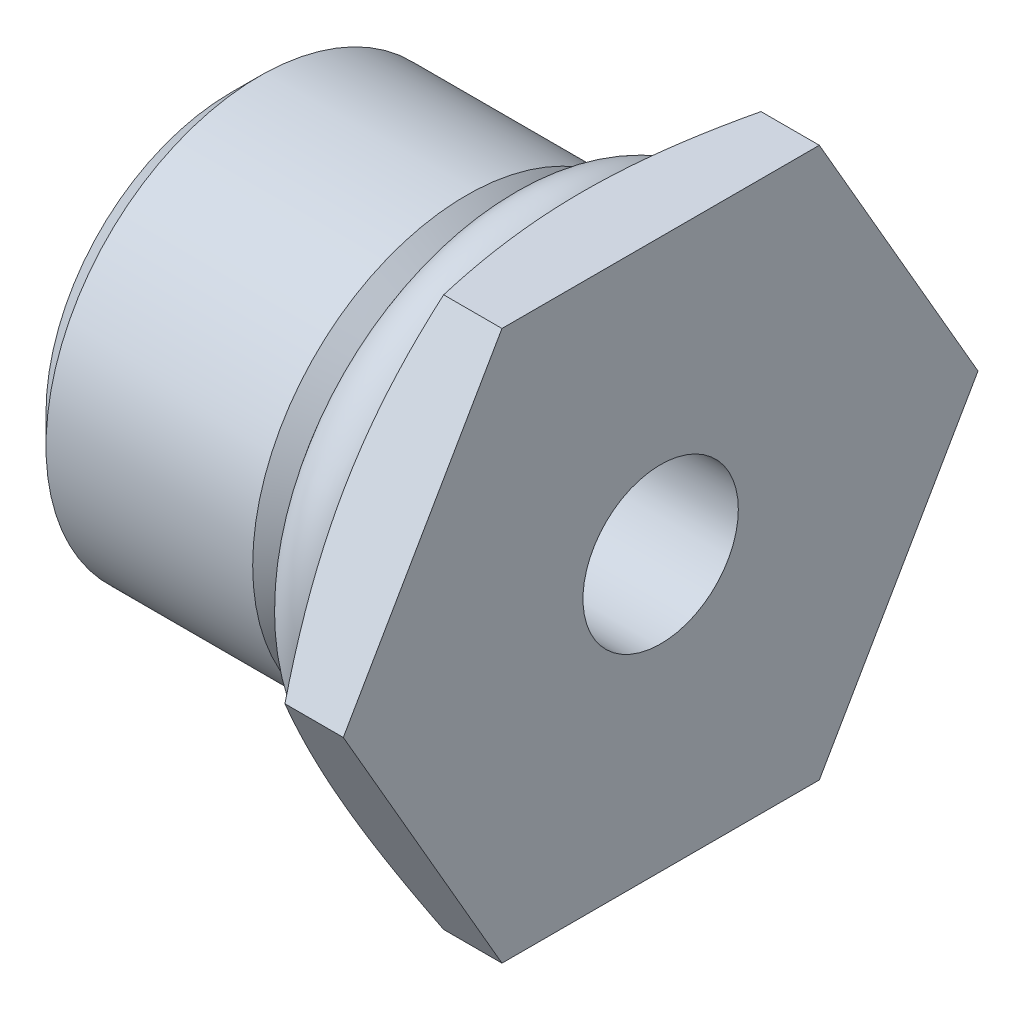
ISO-10303-21;
HEADER;
FILE_DESCRIPTION(('STEP AP214'),'2;1');
FILE_NAME('part.step','',(''),(''),'','','');
FILE_SCHEMA(('AUTOMOTIVE_DESIGN { 1 0 10303 214 1 1 1 1 }'));
ENDSEC;
DATA;
#1=APPLICATION_CONTEXT('core data for automotive mechanical design processes');
#2=APPLICATION_PROTOCOL_DEFINITION('international standard','automotive_design',2000,#1);
#3=PRODUCT_CONTEXT('',#1,'mechanical');
#4=PRODUCT('Part','Part','',(#3));
#5=PRODUCT_RELATED_PRODUCT_CATEGORY('part','',(#4));
#6=PRODUCT_DEFINITION_FORMATION('','',#4);
#7=PRODUCT_DEFINITION_CONTEXT('part definition',#1,'design');
#8=PRODUCT_DEFINITION('design','',#6,#7);
#9=PRODUCT_DEFINITION_SHAPE('','',#8);
#10=(LENGTH_UNIT() NAMED_UNIT(*) SI_UNIT(.MILLI.,.METRE.));
#11=(NAMED_UNIT(*) PLANE_ANGLE_UNIT() SI_UNIT($,.RADIAN.));
#12=(NAMED_UNIT(*) SI_UNIT($,.STERADIAN.) SOLID_ANGLE_UNIT());
#13=UNCERTAINTY_MEASURE_WITH_UNIT(LENGTH_MEASURE(1.E-05),#10,'distance_accuracy_value','');
#14=(GEOMETRIC_REPRESENTATION_CONTEXT(3) GLOBAL_UNCERTAINTY_ASSIGNED_CONTEXT((#13)) GLOBAL_UNIT_ASSIGNED_CONTEXT((#10,
#11,#12)) REPRESENTATION_CONTEXT('',''));
#15=CARTESIAN_POINT('',(0.,0.,0.));
#16=DIRECTION('',(0.,0.,1.));
#17=DIRECTION('',(1.,0.,0.));
#18=AXIS2_PLACEMENT_3D('',#15,#16,#17);
#19=CARTESIAN_POINT('',(11.176,7.14375,-8.2488919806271));
#20=DIRECTION('',(-1.,0.,0.));
#21=DIRECTION('',(0.,-1.,0.));
#22=AXIS2_PLACEMENT_3D('',#19,#20,#21);
#23=PLANE('',#22);
#24=DIRECTION('',(0.,-0.866025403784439,0.5));
#25=VECTOR('',#24,1.);
#26=CARTESIAN_POINT('',(11.176,0.,8.24889197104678));
#27=LINE('',#26,#25);
#28=CARTESIAN_POINT('',(11.176,7.14375,4.12444598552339));
#29=VERTEX_POINT('',#28);
#30=CARTESIAN_POINT('',(11.176,0.,8.24889197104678));
#31=VERTEX_POINT('',#30);
#32=EDGE_CURVE('P0_E98',#29,#31,#27,.T.);
#33=ORIENTED_EDGE('',*,*,#32,.T.);
#34=DIRECTION('',(0.,-0.866025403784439,-0.5));
#35=VECTOR('',#34,1.);
#36=CARTESIAN_POINT('',(11.176,-7.14375,4.12444598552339));
#37=LINE('',#36,#35);
#38=CARTESIAN_POINT('',(11.176,-7.14374999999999,4.12444598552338));
#39=VERTEX_POINT('',#38);
#40=EDGE_CURVE('P0_E120',#31,#39,#37,.T.);
#41=ORIENTED_EDGE('',*,*,#40,.T.);
#42=DIRECTION('',(0.,0.,1.));
#43=VECTOR('',#42,1.);
#44=CARTESIAN_POINT('',(11.176,-7.14374999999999,-8.2488919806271));
#45=LINE('',#44,#43);
#46=CARTESIAN_POINT('',(11.176,-7.14374999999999,-4.12444598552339));
#47=VERTEX_POINT('',#46);
#48=EDGE_CURVE('P0_E360',#47,#39,#45,.T.);
#49=ORIENTED_EDGE('',*,*,#48,.F.);
#50=DIRECTION('',(0.,0.866025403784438,-0.500000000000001));
#51=VECTOR('',#50,1.);
#52=CARTESIAN_POINT('',(11.176,0.,-8.24889197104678));
#53=LINE('',#52,#51);
#54=CARTESIAN_POINT('',(11.176,0.,-8.24889197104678));
#55=VERTEX_POINT('',#54);
#56=EDGE_CURVE('P0_E53',#47,#55,#53,.T.);
#57=ORIENTED_EDGE('',*,*,#56,.T.);
#58=DIRECTION('',(0.,0.866025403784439,0.5));
#59=VECTOR('',#58,1.);
#60=CARTESIAN_POINT('',(11.176,7.14375,-4.1244459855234));
#61=LINE('',#60,#59);
#62=CARTESIAN_POINT('',(11.176,7.14375,-4.12444598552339));
#63=VERTEX_POINT('',#62);
#64=EDGE_CURVE('P0_E11',#55,#63,#61,.T.);
#65=ORIENTED_EDGE('',*,*,#64,.T.);
#66=DIRECTION('',(0.,0.,1.));
#67=VECTOR('',#66,1.);
#68=CARTESIAN_POINT('',(11.176,7.14375,-8.2488919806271));
#69=LINE('',#68,#67);
#70=EDGE_CURVE('P0_E317',#63,#29,#69,.T.);
#71=ORIENTED_EDGE('',*,*,#70,.T.);
#72=EDGE_LOOP('',(#33,#41,#49,#57,#65,#71));
#73=FACE_BOUND('',#72,.T.);
#74=CARTESIAN_POINT('',(11.176,0.,0.));
#75=DIRECTION('',(1.,0.,0.));
#76=DIRECTION('',(0.,0.,-1.));
#77=AXIS2_PLACEMENT_3D('',#74,#75,#76);
#78=CIRCLE('',#77,2.01929999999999);
#79=CARTESIAN_POINT('',(11.176,0.,-2.01929999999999));
#80=VERTEX_POINT('',#79);
#81=EDGE_CURVE('P0_E364',#80,#80,#78,.T.);
#82=ORIENTED_EDGE('',*,*,#81,.F.);
#83=EDGE_LOOP('',(#82));
#84=FACE_BOUND('',#83,.T.);
#85=ADVANCED_FACE('P0_F38',(#73,#84),#23,.F.);
#86=CARTESIAN_POINT('',(0.,0.,0.));
#87=DIRECTION('',(-1.,0.,0.));
#88=DIRECTION('',(0.,0.,1.));
#89=AXIS2_PLACEMENT_3D('',#86,#87,#88);
#90=CONICAL_SURFACE('',#89,2.88036000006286,1.02974425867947);
#91=CARTESIAN_POINT('',(0.517377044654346,0.,0.));
#92=DIRECTION('',(-1.,0.,0.));
#93=DIRECTION('',(0.,0.,1.));
#94=AXIS2_PLACEMENT_3D('',#91,#92,#93);
#95=CIRCLE('',#94,2.01929999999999);
#96=CARTESIAN_POINT('',(0.517377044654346,0.,2.01929999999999));
#97=VERTEX_POINT('',#96);
#98=EDGE_CURVE('P0_E42',#97,#97,#95,.F.);
#99=ORIENTED_EDGE('',*,*,#98,.T.);
#100=EDGE_LOOP('',(#99));
#101=FACE_BOUND('',#100,.T.);
#102=CARTESIAN_POINT('',(1.36620416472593E-10,0.,0.));
#103=DIRECTION('',(-1.,0.,0.));
#104=DIRECTION('',(0.,0.,1.));
#105=AXIS2_PLACEMENT_3D('',#102,#103,#104);
#106=CIRCLE('',#105,2.88035999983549);
#107=CARTESIAN_POINT('',(1.3661988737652E-10,0.,2.88035999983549));
#108=VERTEX_POINT('',#107);
#109=EDGE_CURVE('P0_E278',#108,#108,#106,.F.);
#110=ORIENTED_EDGE('',*,*,#109,.F.);
#111=EDGE_LOOP('',(#110));
#112=FACE_BOUND('',#111,.T.);
#113=ADVANCED_FACE('P0_F40',(#101,#112),#90,.F.);
#114=CARTESIAN_POINT('',(0.,0.,2.4003));
#115=DIRECTION('',(-1.,0.,0.));
#116=DIRECTION('',(0.,0.,1.));
#117=AXIS2_PLACEMENT_3D('',#114,#115,#116);
#118=PLANE('',#117);
#119=CARTESIAN_POINT('',(0.,0.,0.));
#120=DIRECTION('',(1.,0.,0.));
#121=DIRECTION('',(0.,0.,-1.));
#122=AXIS2_PLACEMENT_3D('',#119,#120,#121);
#123=CIRCLE('',#122,4.80060000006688);
#124=CARTESIAN_POINT('',(0.,0.,-4.80060000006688));
#125=VERTEX_POINT('',#124);
#126=EDGE_CURVE('P0_E275',#125,#125,#123,.T.);
#127=ORIENTED_EDGE('',*,*,#126,.F.);
#128=EDGE_LOOP('',(#127));
#129=FACE_BOUND('',#128,.T.);
#130=ORIENTED_EDGE('',*,*,#109,.T.);
#131=EDGE_LOOP('',(#130));
#132=FACE_BOUND('',#131,.T.);
#133=ADVANCED_FACE('P0_F203',(#129,#132),#118,.T.);
#134=CARTESIAN_POINT('',(0.755649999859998,0.,0.));
#135=DIRECTION('',(1.,0.,0.));
#136=DIRECTION('',(0.,0.,-1.));
#137=AXIS2_PLACEMENT_3D('',#134,#135,#136);
#138=CONICAL_SURFACE('',#137,5.55624999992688,0.785398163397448);
#139=ORIENTED_EDGE('',*,*,#126,.T.);
#140=EDGE_LOOP('',(#139));
#141=FACE_BOUND('',#140,.T.);
#142=CARTESIAN_POINT('',(0.75565,0.,0.));
#143=DIRECTION('',(1.,0.,0.));
#144=DIRECTION('',(0.,0.,-1.));
#145=AXIS2_PLACEMENT_3D('',#142,#143,#144);
#146=CIRCLE('',#145,5.55625);
#147=CARTESIAN_POINT('',(0.755650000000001,0.,-5.55625));
#148=VERTEX_POINT('',#147);
#149=EDGE_CURVE('P0_E248',#148,#148,#146,.T.);
#150=ORIENTED_EDGE('',*,*,#149,.F.);
#151=EDGE_LOOP('',(#150));
#152=FACE_BOUND('',#151,.T.);
#153=ADVANCED_FACE('P0_F200',(#141,#152),#138,.T.);
#154=CARTESIAN_POINT('',(3.4417,0.,0.));
#155=DIRECTION('',(1.,0.,0.));
#156=DIRECTION('',(0.,0.,-1.));
#157=AXIS2_PLACEMENT_3D('',#154,#155,#156);
#158=CYLINDRICAL_SURFACE('',#157,5.55625);
#159=ORIENTED_EDGE('',*,*,#149,.T.);
#160=EDGE_LOOP('',(#159));
#161=FACE_BOUND('',#160,.T.);
#162=CARTESIAN_POINT('',(6.12775000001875,0.,0.));
#163=DIRECTION('',(-1.,0.,0.));
#164=DIRECTION('',(0.,0.,1.));
#165=AXIS2_PLACEMENT_3D('',#162,#163,#164);
#166=CIRCLE('',#165,5.55624999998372);
#167=CARTESIAN_POINT('',(6.12775000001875,0.,5.55624999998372));
#168=VERTEX_POINT('',#167);
#169=EDGE_CURVE('P0_E298',#168,#168,#166,.F.);
#170=ORIENTED_EDGE('',*,*,#169,.F.);
#171=EDGE_LOOP('',(#170));
#172=FACE_BOUND('',#171,.T.);
#173=ADVANCED_FACE('P0_F196',(#161,#172),#158,.T.);
#174=CARTESIAN_POINT('',(6.12774999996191,0.,0.));
#175=DIRECTION('',(-1.,0.,0.));
#176=DIRECTION('',(0.,0.,1.));
#177=AXIS2_PLACEMENT_3D('',#174,#175,#176);
#178=CONICAL_SURFACE('',#177,5.55625000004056,0.785398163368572);
#179=ORIENTED_EDGE('',*,*,#169,.T.);
#180=EDGE_LOOP('',(#179));
#181=FACE_BOUND('',#180,.T.);
#182=CARTESIAN_POINT('',(7.112,0.,0.));
#183=DIRECTION('',(1.,0.,0.));
#184=DIRECTION('',(0.,0.,-1.));
#185=AXIS2_PLACEMENT_3D('',#182,#183,#184);
#186=CIRCLE('',#185,4.572);
#187=CARTESIAN_POINT('',(7.112,0.,-4.572));
#188=VERTEX_POINT('',#187);
#189=EDGE_CURVE('P0_E274',#188,#188,#186,.T.);
#190=ORIENTED_EDGE('',*,*,#189,.F.);
#191=EDGE_LOOP('',(#190));
#192=FACE_BOUND('',#191,.T.);
#193=ADVANCED_FACE('P0_F192',(#181,#192),#178,.T.);
#194=CARTESIAN_POINT('',(8.128,0.,0.));
#195=DIRECTION('',(1.,0.,0.));
#196=DIRECTION('',(0.,0.,-1.));
#197=AXIS2_PLACEMENT_3D('',#194,#195,#196);
#198=CYLINDRICAL_SURFACE('',#197,4.572);
#199=ORIENTED_EDGE('',*,*,#189,.T.);
#200=EDGE_LOOP('',(#199));
#201=FACE_BOUND('',#200,.T.);
#202=CARTESIAN_POINT('',(9.144,0.,0.));
#203=DIRECTION('',(1.,0.,0.));
#204=DIRECTION('',(0.,0.,-1.));
#205=AXIS2_PLACEMENT_3D('',#202,#203,#204);
#206=CIRCLE('',#205,4.572);
#207=CARTESIAN_POINT('',(9.144,0.,-4.572));
#208=VERTEX_POINT('',#207);
#209=EDGE_CURVE('P0_E271',#208,#208,#206,.F.);
#210=ORIENTED_EDGE('',*,*,#209,.T.);
#211=EDGE_LOOP('',(#210));
#212=FACE_BOUND('',#211,.T.);
#213=ADVANCED_FACE('P0_F189',(#201,#212),#198,.T.);
#214=CARTESIAN_POINT('',(9.144,0.,0.));
#215=DIRECTION('',(1.,0.,0.));
#216=DIRECTION('',(0.,1.,0.));
#217=AXIS2_PLACEMENT_3D('',#214,#215,#216);
#218=PLANE('',#217);
#219=CARTESIAN_POINT('',(9.144,0.,0.));
#220=DIRECTION('',(1.,0.,0.));
#221=DIRECTION('',(0.,0.,-1.));
#222=AXIS2_PLACEMENT_3D('',#219,#220,#221);
#223=CIRCLE('',#222,7.14375);
#224=CARTESIAN_POINT('',(9.144,3.571875,6.18666897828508));
#225=VERTEX_POINT('',#224);
#226=CARTESIAN_POINT('',(9.144,7.14375,0.));
#227=VERTEX_POINT('',#226);
#228=EDGE_CURVE('P0_E90',#225,#227,#223,.F.);
#229=ORIENTED_EDGE('',*,*,#228,.T.);
#230=CARTESIAN_POINT('',(9.144,0.,0.));
#231=DIRECTION('',(1.,0.,0.));
#232=DIRECTION('',(0.,0.,-1.));
#233=AXIS2_PLACEMENT_3D('',#230,#231,#232);
#234=CIRCLE('',#233,7.14375);
#235=CARTESIAN_POINT('',(9.144,3.571875,-6.18666897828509));
#236=VERTEX_POINT('',#235);
#237=EDGE_CURVE('P0_E261',#227,#236,#234,.F.);
#238=ORIENTED_EDGE('',*,*,#237,.T.);
#239=CARTESIAN_POINT('',(9.144,0.,0.));
#240=DIRECTION('',(1.,0.,0.));
#241=DIRECTION('',(0.,0.,-1.));
#242=AXIS2_PLACEMENT_3D('',#239,#240,#241);
#243=CIRCLE('',#242,7.14375);
#244=CARTESIAN_POINT('',(9.144,-3.57187500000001,-6.18666897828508));
#245=VERTEX_POINT('',#244);
#246=EDGE_CURVE('P0_E263',#236,#245,#243,.F.);
#247=ORIENTED_EDGE('',*,*,#246,.T.);
#248=CARTESIAN_POINT('',(9.144,0.,0.));
#249=DIRECTION('',(1.,0.,0.));
#250=DIRECTION('',(0.,0.,-1.));
#251=AXIS2_PLACEMENT_3D('',#248,#249,#250);
#252=CIRCLE('',#251,7.14375);
#253=CARTESIAN_POINT('',(9.144,-7.14375,0.));
#254=VERTEX_POINT('',#253);
#255=EDGE_CURVE('P0_E265',#245,#254,#252,.F.);
#256=ORIENTED_EDGE('',*,*,#255,.T.);
#257=CARTESIAN_POINT('',(9.144,0.,0.));
#258=DIRECTION('',(1.,0.,0.));
#259=DIRECTION('',(0.,0.,-1.));
#260=AXIS2_PLACEMENT_3D('',#257,#258,#259);
#261=CIRCLE('',#260,7.14375);
#262=CARTESIAN_POINT('',(9.144,-3.571875,6.18666897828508));
#263=VERTEX_POINT('',#262);
#264=EDGE_CURVE('P0_E267',#254,#263,#261,.F.);
#265=ORIENTED_EDGE('',*,*,#264,.T.);
#266=CARTESIAN_POINT('',(9.144,0.,0.));
#267=DIRECTION('',(1.,0.,0.));
#268=DIRECTION('',(0.,0.,-1.));
#269=AXIS2_PLACEMENT_3D('',#266,#267,#268);
#270=CIRCLE('',#269,7.14375);
#271=EDGE_CURVE('P0_E133',#263,#225,#270,.F.);
#272=ORIENTED_EDGE('',*,*,#271,.T.);
#273=EDGE_LOOP('',(#229,#238,#247,#256,#265,#272));
#274=FACE_BOUND('',#273,.T.);
#275=ORIENTED_EDGE('',*,*,#209,.F.);
#276=EDGE_LOOP('',(#275));
#277=FACE_BOUND('',#276,.T.);
#278=ADVANCED_FACE('P0_F184',(#274,#277),#218,.F.);
#279=CARTESIAN_POINT('',(9.144,0.,0.));
#280=DIRECTION('',(1.,0.,0.));
#281=DIRECTION('',(0.,0.,-1.));
#282=AXIS2_PLACEMENT_3D('',#279,#280,#281);
#283=CONICAL_SURFACE('',#282,7.14375,1.13446401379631);
#284=ORIENTED_EDGE('',*,*,#228,.F.);
#285=CARTESIAN_POINT('',(9.65933616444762,7.14375,4.12444598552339));
#286=CARTESIAN_POINT('',(9.58040947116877,6.85069189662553,4.29364316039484));
#287=CARTESIAN_POINT('',(9.50838008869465,6.55605482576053,4.46375195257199));
#288=CARTESIAN_POINT('',(9.38158796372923,5.96505481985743,4.80496596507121));
#289=CARTESIAN_POINT('',(9.32676799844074,5.66870101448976,4.97606591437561));
#290=CARTESIAN_POINT('',(9.25964246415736,5.22234154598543,5.23377167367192));
#291=CARTESIAN_POINT('',(9.2397794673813,5.0731865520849,5.31988634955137));
#292=CARTESIAN_POINT('',(9.20543600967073,4.77441098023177,5.49238450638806));
#293=CARTESIAN_POINT('',(9.19095547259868,4.62479040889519,5.57876798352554));
#294=CARTESIAN_POINT('',(9.16761931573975,4.32471681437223,5.75201555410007));
#295=CARTESIAN_POINT('',(9.15878262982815,4.17426267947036,5.83888028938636));
#296=CARTESIAN_POINT('',(9.14696231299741,3.87316545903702,6.01271885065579));
#297=CARTESIAN_POINT('',(9.14397935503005,3.72252235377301,6.09969268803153));
#298=CARTESIAN_POINT('',(9.144,3.571875,6.18666897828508));
#299=B_SPLINE_CURVE_WITH_KNOTS('',3,(#285,#286,#287,#288,#289,#290,#291,#292,#293,#294,#295,
#296,#297,#298),.UNSPECIFIED.,.F.,.F.,(4,2,2,2,2,2,4),(0.,1.04269338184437,2.08188206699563,
2.60191814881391,3.12194687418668,3.64371114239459,4.1655353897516),.UNSPECIFIED.);
#300=CARTESIAN_POINT('',(9.65933616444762,7.14375,4.12444598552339));
#301=VERTEX_POINT('',#300);
#302=EDGE_CURVE('P0_E128',#301,#225,#299,.T.);
#303=ORIENTED_EDGE('',*,*,#302,.F.);
#304=CARTESIAN_POINT('',(9.144,7.14375,0.));
#305=CARTESIAN_POINT('',(9.14397935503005,7.14375,0.1739525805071));
#306=CARTESIAN_POINT('',(9.14696231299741,7.14375,0.347900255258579));
#307=CARTESIAN_POINT('',(9.15878262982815,7.14375,0.695577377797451));
#308=CARTESIAN_POINT('',(9.16761931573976,7.14375,0.869306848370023));
#309=CARTESIAN_POINT('',(9.19095547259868,7.14375,1.21580198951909));
#310=CARTESIAN_POINT('',(9.20543600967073,7.14375,1.38856894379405));
#311=CARTESIAN_POINT('',(9.2397794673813,7.14375,1.73356525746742));
#312=CARTESIAN_POINT('',(9.25964246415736,7.14375,1.90579460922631));
#313=CARTESIAN_POINT('',(9.32676799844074,7.14375,2.42120612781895));
#314=CARTESIAN_POINT('',(9.38158796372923,7.14375,2.76340602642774));
#315=CARTESIAN_POINT('',(9.50838008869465,7.14375,3.44583405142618));
#316=CARTESIAN_POINT('',(9.58040947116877,7.14375,3.78605163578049));
#317=CARTESIAN_POINT('',(9.65933616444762,7.14375,4.12444598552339));
#318=B_SPLINE_CURVE_WITH_KNOTS('',3,(#304,#305,#306,#307,#308,#309,#310,#311,#312,#313,#314,
#315,#316,#317),.UNSPECIFIED.,.F.,.F.,(4,2,2,2,2,2,4),(0.,0.521824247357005,1.04358851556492,
1.56361724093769,2.08365332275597,3.12284200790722,4.16553538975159),.UNSPECIFIED.);
#319=EDGE_CURVE('P0_E175',#227,#301,#318,.T.);
#320=ORIENTED_EDGE('',*,*,#319,.F.);
#321=EDGE_LOOP('',(#284,#303,#320));
#322=FACE_BOUND('',#321,.T.);
#323=ADVANCED_FACE('P0_F180',(#322),#283,.T.);
#324=CARTESIAN_POINT('',(9.144,0.,0.));
#325=DIRECTION('',(1.,0.,0.));
#326=DIRECTION('',(0.,0.,-1.));
#327=AXIS2_PLACEMENT_3D('',#324,#325,#326);
#328=CONICAL_SURFACE('',#327,7.14375,1.13446401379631);
#329=ORIENTED_EDGE('',*,*,#271,.F.);
#330=CARTESIAN_POINT('',(9.65933616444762,0.,8.24889197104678));
#331=CARTESIAN_POINT('',(9.58040947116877,-0.293058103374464,8.07969479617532));
#332=CARTESIAN_POINT('',(9.50838008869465,-0.587695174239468,7.90958600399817));
#333=CARTESIAN_POINT('',(9.38158796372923,-1.17869518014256,7.56837199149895));
#334=CARTESIAN_POINT('',(9.32676799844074,-1.47504898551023,7.39727204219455));
#335=CARTESIAN_POINT('',(9.25964246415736,-1.92140845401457,7.13956628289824));
#336=CARTESIAN_POINT('',(9.2397794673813,-2.0705634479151,7.05345160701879));
#337=CARTESIAN_POINT('',(9.20543600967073,-2.36933901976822,6.88095345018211));
#338=CARTESIAN_POINT('',(9.19095547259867,-2.51895959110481,6.79456997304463));
#339=CARTESIAN_POINT('',(9.16761931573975,-2.81903318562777,6.62132240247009));
#340=CARTESIAN_POINT('',(9.15878262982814,-2.96948732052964,6.53445766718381));
#341=CARTESIAN_POINT('',(9.14696231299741,-3.27058454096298,6.36061910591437));
#342=CARTESIAN_POINT('',(9.14397935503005,-3.42122764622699,6.27364526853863));
#343=CARTESIAN_POINT('',(9.144,-3.571875,6.18666897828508));
#344=B_SPLINE_CURVE_WITH_KNOTS('',3,(#330,#331,#332,#333,#334,#335,#336,#337,#338,#339,#340,
#341,#342,#343),.UNSPECIFIED.,.F.,.F.,(4,2,2,2,2,2,4),(0.,1.04269338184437,2.08188206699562,
2.60191814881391,3.12194687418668,3.64371114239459,4.16553538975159),.UNSPECIFIED.);
#345=CARTESIAN_POINT('',(9.65933616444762,0.,8.24889197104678));
#346=VERTEX_POINT('',#345);
#347=EDGE_CURVE('P0_E118',#346,#263,#344,.T.);
#348=ORIENTED_EDGE('',*,*,#347,.F.);
#349=CARTESIAN_POINT('',(9.144,3.571875,6.18666897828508));
#350=CARTESIAN_POINT('',(9.14397935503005,3.42122764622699,6.27364526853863));
#351=CARTESIAN_POINT('',(9.14696231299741,3.27058454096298,6.36061910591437));
#352=CARTESIAN_POINT('',(9.15878262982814,2.96948732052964,6.53445766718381));
#353=CARTESIAN_POINT('',(9.16761931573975,2.81903318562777,6.62132240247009));
#354=CARTESIAN_POINT('',(9.19095547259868,2.51895959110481,6.79456997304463));
#355=CARTESIAN_POINT('',(9.20543600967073,2.36933901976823,6.88095345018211));
#356=CARTESIAN_POINT('',(9.2397794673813,2.0705634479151,7.05345160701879));
#357=CARTESIAN_POINT('',(9.25964246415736,1.92140845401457,7.13956628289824));
#358=CARTESIAN_POINT('',(9.32676799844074,1.47504898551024,7.39727204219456));
#359=CARTESIAN_POINT('',(9.38158796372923,1.17869518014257,7.56837199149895));
#360=CARTESIAN_POINT('',(9.50838008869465,0.587695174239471,7.90958600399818));
#361=CARTESIAN_POINT('',(9.58040947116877,0.293058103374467,8.07969479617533));
#362=CARTESIAN_POINT('',(9.65933616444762,0.,8.24889197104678));
#363=B_SPLINE_CURVE_WITH_KNOTS('',3,(#349,#350,#351,#352,#353,#354,#355,#356,#357,#358,#359,
#360,#361,#362),.UNSPECIFIED.,.F.,.F.,(4,2,2,2,2,2,4),(0.,0.521824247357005,1.04358851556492,
1.56361724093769,2.08365332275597,3.12284200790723,4.16553538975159),.UNSPECIFIED.);
#364=EDGE_CURVE('P0_E122',#225,#346,#363,.T.);
#365=ORIENTED_EDGE('',*,*,#364,.F.);
#366=EDGE_LOOP('',(#329,#348,#365));
#367=FACE_BOUND('',#366,.T.);
#368=ADVANCED_FACE('P0_F132',(#367),#328,.T.);
#369=CARTESIAN_POINT('',(9.144,0.,0.));
#370=DIRECTION('',(1.,0.,0.));
#371=DIRECTION('',(0.,0.,-1.));
#372=AXIS2_PLACEMENT_3D('',#369,#370,#371);
#373=CONICAL_SURFACE('',#372,7.14375,1.13446401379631);
#374=CARTESIAN_POINT('',(9.144,-3.571875,6.18666897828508));
#375=CARTESIAN_POINT('',(9.14397935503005,-3.722522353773,6.09969268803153));
#376=CARTESIAN_POINT('',(9.14696231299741,-3.87316545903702,6.01271885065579));
#377=CARTESIAN_POINT('',(9.15878262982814,-4.17426267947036,5.83888028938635));
#378=CARTESIAN_POINT('',(9.16761931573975,-4.32471681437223,5.75201555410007));
#379=CARTESIAN_POINT('',(9.19095547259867,-4.62479040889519,5.57876798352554));
#380=CARTESIAN_POINT('',(9.20543600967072,-4.77441098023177,5.49238450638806));
#381=CARTESIAN_POINT('',(9.2397794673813,-5.07318655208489,5.31988634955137));
#382=CARTESIAN_POINT('',(9.25964246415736,-5.22234154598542,5.23377167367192));
#383=CARTESIAN_POINT('',(9.32676799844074,-5.66870101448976,4.97606591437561));
#384=CARTESIAN_POINT('',(9.38158796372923,-5.96505481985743,4.80496596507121));
#385=CARTESIAN_POINT('',(9.50838008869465,-6.55605482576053,4.46375195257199));
#386=CARTESIAN_POINT('',(9.58040947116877,-6.85069189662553,4.29364316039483));
#387=CARTESIAN_POINT('',(9.65933616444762,-7.14375,4.12444598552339));
#388=B_SPLINE_CURVE_WITH_KNOTS('',3,(#374,#375,#376,#377,#378,#379,#380,#381,#382,#383,#384,
#385,#386,#387),.UNSPECIFIED.,.F.,.F.,(4,2,2,2,2,2,4),(0.,0.521824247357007,1.04358851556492,
1.56361724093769,2.08365332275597,3.12284200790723,4.1655353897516),.UNSPECIFIED.);
#389=CARTESIAN_POINT('',(9.65933616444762,-7.14375,4.12444598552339));
#390=VERTEX_POINT('',#389);
#391=EDGE_CURVE('P0_E135',#263,#390,#388,.T.);
#392=ORIENTED_EDGE('',*,*,#391,.F.);
#393=ORIENTED_EDGE('',*,*,#264,.F.);
#394=CARTESIAN_POINT('',(9.65933616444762,-7.14374999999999,4.12444598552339));
#395=CARTESIAN_POINT('',(9.58040947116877,-7.14374999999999,3.78605163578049));
#396=CARTESIAN_POINT('',(9.50838008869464,-7.14374999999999,3.44583405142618));
#397=CARTESIAN_POINT('',(9.38158796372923,-7.14374999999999,2.76340602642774));
#398=CARTESIAN_POINT('',(9.32676799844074,-7.14374999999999,2.42120612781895));
#399=CARTESIAN_POINT('',(9.25964246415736,-7.14374999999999,1.90579460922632));
#400=CARTESIAN_POINT('',(9.2397794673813,-7.14374999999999,1.73356525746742));
#401=CARTESIAN_POINT('',(9.20543600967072,-7.14374999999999,1.38856894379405));
#402=CARTESIAN_POINT('',(9.19095547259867,-7.14375,1.21580198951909));
#403=CARTESIAN_POINT('',(9.16761931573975,-7.14375,0.869306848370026));
#404=CARTESIAN_POINT('',(9.15878262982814,-7.14375,0.695577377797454));
#405=CARTESIAN_POINT('',(9.14696231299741,-7.14375,0.347900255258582));
#406=CARTESIAN_POINT('',(9.14397935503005,-7.14375,0.173952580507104));
#407=CARTESIAN_POINT('',(9.144,-7.14375,0.));
#408=B_SPLINE_CURVE_WITH_KNOTS('',3,(#394,#395,#396,#397,#398,#399,#400,#401,#402,#403,#404,
#405,#406,#407),.UNSPECIFIED.,.F.,.F.,(4,2,2,2,2,2,4),(0.,1.04269338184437,2.08188206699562,
2.60191814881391,3.12194687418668,3.64371114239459,4.16553538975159),.UNSPECIFIED.);
#409=EDGE_CURVE('P0_E294',#390,#254,#408,.T.);
#410=ORIENTED_EDGE('',*,*,#409,.F.);
#411=EDGE_LOOP('',(#392,#393,#410));
#412=FACE_BOUND('',#411,.T.);
#413=ADVANCED_FACE('P0_F346',(#412),#373,.T.);
#414=CARTESIAN_POINT('',(9.144,0.,0.));
#415=DIRECTION('',(1.,0.,0.));
#416=DIRECTION('',(0.,0.,-1.));
#417=AXIS2_PLACEMENT_3D('',#414,#415,#416);
#418=CONICAL_SURFACE('',#417,7.14375,1.13446401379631);
#419=CARTESIAN_POINT('',(9.144,-7.14375,0.));
#420=CARTESIAN_POINT('',(9.14397935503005,-7.14375,-0.1739525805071));
#421=CARTESIAN_POINT('',(9.14696231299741,-7.14375,-0.347900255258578));
#422=CARTESIAN_POINT('',(9.15878262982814,-7.14375,-0.69557737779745));
#423=CARTESIAN_POINT('',(9.16761931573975,-7.14375,-0.869306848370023));
#424=CARTESIAN_POINT('',(9.19095547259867,-7.14375,-1.21580198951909));
#425=CARTESIAN_POINT('',(9.20543600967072,-7.14375,-1.38856894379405));
#426=CARTESIAN_POINT('',(9.2397794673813,-7.14375,-1.73356525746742));
#427=CARTESIAN_POINT('',(9.25964246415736,-7.14375,-1.90579460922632));
#428=CARTESIAN_POINT('',(9.32676799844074,-7.14375,-2.42120612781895));
#429=CARTESIAN_POINT('',(9.38158796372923,-7.14375,-2.76340602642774));
#430=CARTESIAN_POINT('',(9.50838008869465,-7.14375,-3.44583405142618));
#431=CARTESIAN_POINT('',(9.58040947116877,-7.14375,-3.78605163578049));
#432=CARTESIAN_POINT('',(9.65933616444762,-7.14375,-4.12444598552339));
#433=B_SPLINE_CURVE_WITH_KNOTS('',3,(#419,#420,#421,#422,#423,#424,#425,#426,#427,#428,#429,
#430,#431,#432),.UNSPECIFIED.,.F.,.F.,(4,2,2,2,2,2,4),(0.,0.521824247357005,1.04358851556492,
1.56361724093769,2.08365332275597,3.12284200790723,4.1655353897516),.UNSPECIFIED.);
#434=CARTESIAN_POINT('',(9.65933616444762,-7.14375,-4.12444598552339));
#435=VERTEX_POINT('',#434);
#436=EDGE_CURVE('P0_E293',#254,#435,#433,.T.);
#437=ORIENTED_EDGE('',*,*,#436,.F.);
#438=ORIENTED_EDGE('',*,*,#255,.F.);
#439=CARTESIAN_POINT('',(9.65933616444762,-7.14375,-4.12444598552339));
#440=CARTESIAN_POINT('',(9.58040947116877,-6.85069189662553,-4.29364316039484));
#441=CARTESIAN_POINT('',(9.50838008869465,-6.55605482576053,-4.46375195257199));
#442=CARTESIAN_POINT('',(9.38158796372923,-5.96505481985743,-4.80496596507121));
#443=CARTESIAN_POINT('',(9.32676799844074,-5.66870101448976,-4.97606591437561));
#444=CARTESIAN_POINT('',(9.25964246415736,-5.22234154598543,-5.23377167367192));
#445=CARTESIAN_POINT('',(9.2397794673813,-5.0731865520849,-5.31988634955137));
#446=CARTESIAN_POINT('',(9.20543600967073,-4.77441098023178,-5.49238450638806));
#447=CARTESIAN_POINT('',(9.19095547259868,-4.6247904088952,-5.57876798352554));
#448=CARTESIAN_POINT('',(9.16761931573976,-4.32471681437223,-5.75201555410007));
#449=CARTESIAN_POINT('',(9.15878262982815,-4.17426267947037,-5.83888028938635));
#450=CARTESIAN_POINT('',(9.14696231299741,-3.87316545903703,-6.01271885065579));
#451=CARTESIAN_POINT('',(9.14397935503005,-3.72252235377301,-6.09969268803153));
#452=CARTESIAN_POINT('',(9.144,-3.57187500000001,-6.18666897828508));
#453=B_SPLINE_CURVE_WITH_KNOTS('',3,(#439,#440,#441,#442,#443,#444,#445,#446,#447,#448,#449,
#450,#451,#452),.UNSPECIFIED.,.F.,.F.,(4,2,2,2,2,2,4),(0.,1.04269338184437,2.08188206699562,
2.6019181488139,3.12194687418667,3.64371114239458,4.16553538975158),.UNSPECIFIED.);
#454=EDGE_CURVE('P0_E292',#435,#245,#453,.T.);
#455=ORIENTED_EDGE('',*,*,#454,.F.);
#456=EDGE_LOOP('',(#437,#438,#455));
#457=FACE_BOUND('',#456,.T.);
#458=ADVANCED_FACE('P0_F343',(#457),#418,.T.);
#459=CARTESIAN_POINT('',(9.144,0.,0.));
#460=DIRECTION('',(1.,0.,0.));
#461=DIRECTION('',(0.,0.,-1.));
#462=AXIS2_PLACEMENT_3D('',#459,#460,#461);
#463=CONICAL_SURFACE('',#462,7.14375,1.13446401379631);
#464=ORIENTED_EDGE('',*,*,#246,.F.);
#465=CARTESIAN_POINT('',(9.65933616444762,0.,-8.24889197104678));
#466=CARTESIAN_POINT('',(9.58040947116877,0.293058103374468,-8.07969479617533));
#467=CARTESIAN_POINT('',(9.50838008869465,0.587695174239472,-7.90958600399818));
#468=CARTESIAN_POINT('',(9.38158796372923,1.17869518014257,-7.56837199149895));
#469=CARTESIAN_POINT('',(9.32676799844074,1.47504898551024,-7.39727204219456));
#470=CARTESIAN_POINT('',(9.25964246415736,1.92140845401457,-7.13956628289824));
#471=CARTESIAN_POINT('',(9.2397794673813,2.0705634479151,-7.0534516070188));
#472=CARTESIAN_POINT('',(9.20543600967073,2.36933901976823,-6.88095345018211));
#473=CARTESIAN_POINT('',(9.19095547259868,2.51895959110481,-6.79456997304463));
#474=CARTESIAN_POINT('',(9.16761931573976,2.81903318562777,-6.6213224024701));
#475=CARTESIAN_POINT('',(9.15878262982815,2.96948732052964,-6.53445766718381));
#476=CARTESIAN_POINT('',(9.14696231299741,3.27058454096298,-6.36061910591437));
#477=CARTESIAN_POINT('',(9.14397935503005,3.42122764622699,-6.27364526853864));
#478=CARTESIAN_POINT('',(9.144,3.571875,-6.18666897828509));
#479=B_SPLINE_CURVE_WITH_KNOTS('',3,(#465,#466,#467,#468,#469,#470,#471,#472,#473,#474,#475,
#476,#477,#478),.UNSPECIFIED.,.F.,.F.,(4,2,2,2,2,2,4),(0.,1.04269338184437,2.08188206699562,
2.60191814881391,3.12194687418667,3.64371114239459,4.16553538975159),.UNSPECIFIED.);
#480=CARTESIAN_POINT('',(9.65933616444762,0.,-8.24889197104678));
#481=VERTEX_POINT('',#480);
#482=EDGE_CURVE('P0_E235',#481,#236,#479,.T.);
#483=ORIENTED_EDGE('',*,*,#482,.F.);
#484=CARTESIAN_POINT('',(9.144,-3.57187500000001,-6.18666897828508));
#485=CARTESIAN_POINT('',(9.14397935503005,-3.421227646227,-6.27364526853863));
#486=CARTESIAN_POINT('',(9.14696231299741,-3.27058454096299,-6.36061910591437));
#487=CARTESIAN_POINT('',(9.15878262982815,-2.96948732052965,-6.53445766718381));
#488=CARTESIAN_POINT('',(9.16761931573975,-2.81903318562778,-6.62132240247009));
#489=CARTESIAN_POINT('',(9.19095547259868,-2.51895959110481,-6.79456997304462));
#490=CARTESIAN_POINT('',(9.20543600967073,-2.36933901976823,-6.88095345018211));
#491=CARTESIAN_POINT('',(9.2397794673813,-2.07056344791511,-7.05345160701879));
#492=CARTESIAN_POINT('',(9.25964246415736,-1.92140845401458,-7.13956628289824));
#493=CARTESIAN_POINT('',(9.32676799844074,-1.47504898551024,-7.39727204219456));
#494=CARTESIAN_POINT('',(9.38158796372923,-1.17869518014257,-7.56837199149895));
#495=CARTESIAN_POINT('',(9.50838008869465,-0.587695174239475,-7.90958600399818));
#496=CARTESIAN_POINT('',(9.58040947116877,-0.29305810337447,-8.07969479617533));
#497=CARTESIAN_POINT('',(9.65933616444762,0.,-8.24889197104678));
#498=B_SPLINE_CURVE_WITH_KNOTS('',3,(#484,#485,#486,#487,#488,#489,#490,#491,#492,#493,#494,
#495,#496,#497),.UNSPECIFIED.,.F.,.F.,(4,2,2,2,2,2,4),(0.,0.521824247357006,1.04358851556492,
1.56361724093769,2.08365332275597,3.12284200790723,4.1655353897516),.UNSPECIFIED.);
#499=EDGE_CURVE('P0_E289',#245,#481,#498,.T.);
#500=ORIENTED_EDGE('',*,*,#499,.F.);
#501=EDGE_LOOP('',(#464,#483,#500));
#502=FACE_BOUND('',#501,.T.);
#503=ADVANCED_FACE('P0_F253',(#502),#463,.T.);
#504=CARTESIAN_POINT('',(9.144,0.,0.));
#505=DIRECTION('',(1.,0.,0.));
#506=DIRECTION('',(0.,0.,-1.));
#507=AXIS2_PLACEMENT_3D('',#504,#505,#506);
#508=CONICAL_SURFACE('',#507,7.14375,1.13446401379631);
#509=ORIENTED_EDGE('',*,*,#237,.F.);
#510=CARTESIAN_POINT('',(9.65933616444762,7.14375,-4.12444598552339));
#511=CARTESIAN_POINT('',(9.58040947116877,7.14375,-3.78605163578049));
#512=CARTESIAN_POINT('',(9.50838008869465,7.14375,-3.44583405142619));
#513=CARTESIAN_POINT('',(9.38158796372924,7.14375,-2.76340602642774));
#514=CARTESIAN_POINT('',(9.32676799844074,7.14375,-2.42120612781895));
#515=CARTESIAN_POINT('',(9.25964246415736,7.14375,-1.90579460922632));
#516=CARTESIAN_POINT('',(9.2397794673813,7.14375,-1.73356525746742));
#517=CARTESIAN_POINT('',(9.20543600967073,7.14375,-1.38856894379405));
#518=CARTESIAN_POINT('',(9.19095547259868,7.14375,-1.21580198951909));
#519=CARTESIAN_POINT('',(9.16761931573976,7.14375,-0.869306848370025));
#520=CARTESIAN_POINT('',(9.15878262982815,7.14375,-0.695577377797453));
#521=CARTESIAN_POINT('',(9.14696231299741,7.14375,-0.34790025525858));
#522=CARTESIAN_POINT('',(9.14397935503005,7.14375,-0.173952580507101));
#523=CARTESIAN_POINT('',(9.144,7.14375,0.));
#524=B_SPLINE_CURVE_WITH_KNOTS('',3,(#510,#511,#512,#513,#514,#515,#516,#517,#518,#519,#520,
#521,#522,#523),.UNSPECIFIED.,.F.,.F.,(4,2,2,2,2,2,4),(0.,1.04269338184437,2.08188206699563,
2.60191814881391,3.12194687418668,3.64371114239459,4.1655353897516),.UNSPECIFIED.);
#525=CARTESIAN_POINT('',(9.65933616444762,7.14375,-4.12444598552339));
#526=VERTEX_POINT('',#525);
#527=EDGE_CURVE('P0_E62',#526,#227,#524,.T.);
#528=ORIENTED_EDGE('',*,*,#527,.F.);
#529=CARTESIAN_POINT('',(9.144,3.571875,-6.18666897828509));
#530=CARTESIAN_POINT('',(9.14397935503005,3.72252235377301,-6.09969268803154));
#531=CARTESIAN_POINT('',(9.14696231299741,3.87316545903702,-6.0127188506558));
#532=CARTESIAN_POINT('',(9.15878262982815,4.17426267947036,-5.83888028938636));
#533=CARTESIAN_POINT('',(9.16761931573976,4.32471681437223,-5.75201555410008));
#534=CARTESIAN_POINT('',(9.19095547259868,4.62479040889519,-5.57876798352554));
#535=CARTESIAN_POINT('',(9.20543600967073,4.77441098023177,-5.49238450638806));
#536=CARTESIAN_POINT('',(9.2397794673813,5.0731865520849,-5.31988634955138));
#537=CARTESIAN_POINT('',(9.25964246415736,5.22234154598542,-5.23377167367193));
#538=CARTESIAN_POINT('',(9.32676799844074,5.66870101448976,-4.97606591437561));
#539=CARTESIAN_POINT('',(9.38158796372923,5.96505481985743,-4.80496596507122));
#540=CARTESIAN_POINT('',(9.50838008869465,6.55605482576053,-4.463751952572));
#541=CARTESIAN_POINT('',(9.58040947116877,6.85069189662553,-4.29364316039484));
#542=CARTESIAN_POINT('',(9.65933616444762,7.14375,-4.1244459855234));
#543=B_SPLINE_CURVE_WITH_KNOTS('',3,(#529,#530,#531,#532,#533,#534,#535,#536,#537,#538,#539,
#540,#541,#542),.UNSPECIFIED.,.F.,.F.,(4,2,2,2,2,2,4),(0.,0.521824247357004,1.04358851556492,
1.56361724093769,2.08365332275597,3.12284200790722,4.16553538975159),.UNSPECIFIED.);
#544=EDGE_CURVE('P0_E242',#236,#526,#543,.T.);
#545=ORIENTED_EDGE('',*,*,#544,.F.);
#546=EDGE_LOOP('',(#509,#528,#545));
#547=FACE_BOUND('',#546,.T.);
#548=ADVANCED_FACE('P0_F250',(#547),#508,.T.);
#549=CARTESIAN_POINT('',(9.144,7.14375,0.));
#550=DIRECTION('',(0.,1.,0.));
#551=DIRECTION('',(0.,0.,1.));
#552=AXIS2_PLACEMENT_3D('',#549,#550,#551);
#553=PLANE('',#552);
#554=ORIENTED_EDGE('',*,*,#70,.F.);
#555=DIRECTION('',(1.,0.,0.));
#556=VECTOR('',#555,1.);
#557=CARTESIAN_POINT('',(9.144,7.14375,-4.12444598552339));
#558=LINE('',#557,#556);
#559=EDGE_CURVE('P0_E47',#526,#63,#558,.T.);
#560=ORIENTED_EDGE('',*,*,#559,.F.);
#561=ORIENTED_EDGE('',*,*,#527,.T.);
#562=ORIENTED_EDGE('',*,*,#319,.T.);
#563=DIRECTION('',(1.,0.,0.));
#564=VECTOR('',#563,1.);
#565=CARTESIAN_POINT('',(9.144,7.14375,4.12444598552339));
#566=LINE('',#565,#564);
#567=EDGE_CURVE('P0_E174',#29,#301,#566,.F.);
#568=ORIENTED_EDGE('',*,*,#567,.F.);
#569=EDGE_LOOP('',(#554,#560,#561,#562,#568));
#570=FACE_BOUND('',#569,.T.);
#571=ADVANCED_FACE('P0_F166',(#570),#553,.T.);
#572=CARTESIAN_POINT('',(9.144,0.,8.24889197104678));
#573=DIRECTION('',(0.,0.5,0.866025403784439));
#574=DIRECTION('',(0.,-0.866025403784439,0.5));
#575=AXIS2_PLACEMENT_3D('',#572,#573,#574);
#576=PLANE('',#575);
#577=ORIENTED_EDGE('',*,*,#32,.F.);
#578=ORIENTED_EDGE('',*,*,#567,.T.);
#579=ORIENTED_EDGE('',*,*,#302,.T.);
#580=ORIENTED_EDGE('',*,*,#364,.T.);
#581=DIRECTION('',(1.,0.,0.));
#582=VECTOR('',#581,1.);
#583=CARTESIAN_POINT('',(9.144,0.,8.24889197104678));
#584=LINE('',#583,#582);
#585=EDGE_CURVE('P0_E113',#31,#346,#584,.F.);
#586=ORIENTED_EDGE('',*,*,#585,.F.);
#587=EDGE_LOOP('',(#577,#578,#579,#580,#586));
#588=FACE_BOUND('',#587,.T.);
#589=ADVANCED_FACE('P0_F126',(#588),#576,.T.);
#590=CARTESIAN_POINT('',(9.144,-7.14375,4.12444598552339));
#591=DIRECTION('',(0.,-0.5,0.866025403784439));
#592=DIRECTION('',(0.,-0.866025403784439,-0.5));
#593=AXIS2_PLACEMENT_3D('',#590,#591,#592);
#594=PLANE('',#593);
#595=ORIENTED_EDGE('',*,*,#40,.F.);
#596=ORIENTED_EDGE('',*,*,#585,.T.);
#597=ORIENTED_EDGE('',*,*,#347,.T.);
#598=ORIENTED_EDGE('',*,*,#391,.T.);
#599=DIRECTION('',(1.,0.,0.));
#600=VECTOR('',#599,1.);
#601=CARTESIAN_POINT('',(9.144,-7.14374999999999,4.12444598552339));
#602=LINE('',#601,#600);
#603=EDGE_CURVE('P0_E137',#39,#390,#602,.F.);
#604=ORIENTED_EDGE('',*,*,#603,.F.);
#605=EDGE_LOOP('',(#595,#596,#597,#598,#604));
#606=FACE_BOUND('',#605,.T.);
#607=ADVANCED_FACE('P0_F115',(#606),#594,.T.);
#608=CARTESIAN_POINT('',(9.144,-7.14375,-4.12444598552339));
#609=DIRECTION('',(0.,-1.,0.));
#610=DIRECTION('',(0.,0.,-1.));
#611=AXIS2_PLACEMENT_3D('',#608,#609,#610);
#612=PLANE('',#611);
#613=ORIENTED_EDGE('',*,*,#48,.T.);
#614=ORIENTED_EDGE('',*,*,#603,.T.);
#615=ORIENTED_EDGE('',*,*,#409,.T.);
#616=ORIENTED_EDGE('',*,*,#436,.T.);
#617=DIRECTION('',(1.,0.,0.));
#618=VECTOR('',#617,1.);
#619=CARTESIAN_POINT('',(9.144,-7.14375,-4.12444598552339));
#620=LINE('',#619,#618);
#621=EDGE_CURVE('P0_E290',#47,#435,#620,.F.);
#622=ORIENTED_EDGE('',*,*,#621,.F.);
#623=EDGE_LOOP('',(#613,#614,#615,#616,#622));
#624=FACE_BOUND('',#623,.T.);
#625=ADVANCED_FACE('P0_F159',(#624),#612,.T.);
#626=CARTESIAN_POINT('',(9.144,0.,-8.24889197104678));
#627=DIRECTION('',(0.,-0.500000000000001,-0.866025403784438));
#628=DIRECTION('',(0.,0.866025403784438,-0.500000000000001));
#629=AXIS2_PLACEMENT_3D('',#626,#627,#628);
#630=PLANE('',#629);
#631=ORIENTED_EDGE('',*,*,#56,.F.);
#632=ORIENTED_EDGE('',*,*,#621,.T.);
#633=ORIENTED_EDGE('',*,*,#454,.T.);
#634=ORIENTED_EDGE('',*,*,#499,.T.);
#635=DIRECTION('',(1.,0.,0.));
#636=VECTOR('',#635,1.);
#637=CARTESIAN_POINT('',(9.144,0.,-8.24889197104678));
#638=LINE('',#637,#636);
#639=EDGE_CURVE('P0_E287',#55,#481,#638,.F.);
#640=ORIENTED_EDGE('',*,*,#639,.F.);
#641=EDGE_LOOP('',(#631,#632,#633,#634,#640));
#642=FACE_BOUND('',#641,.T.);
#643=ADVANCED_FACE('P0_F223',(#642),#630,.T.);
#644=CARTESIAN_POINT('',(9.144,7.14375,-4.1244459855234));
#645=DIRECTION('',(0.,0.5,-0.866025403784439));
#646=DIRECTION('',(0.,0.866025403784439,0.5));
#647=AXIS2_PLACEMENT_3D('',#644,#645,#646);
#648=PLANE('',#647);
#649=ORIENTED_EDGE('',*,*,#64,.F.);
#650=ORIENTED_EDGE('',*,*,#639,.T.);
#651=ORIENTED_EDGE('',*,*,#482,.T.);
#652=ORIENTED_EDGE('',*,*,#544,.T.);
#653=ORIENTED_EDGE('',*,*,#559,.T.);
#654=EDGE_LOOP('',(#649,#650,#651,#652,#653));
#655=FACE_BOUND('',#654,.T.);
#656=ADVANCED_FACE('P0_F216',(#655),#648,.T.);
#657=CARTESIAN_POINT('',(11.176,0.,0.));
#658=DIRECTION('',(1.,0.,0.));
#659=DIRECTION('',(0.,0.,-1.));
#660=AXIS2_PLACEMENT_3D('',#657,#658,#659);
#661=CYLINDRICAL_SURFACE('',#660,2.01929999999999);
#662=ORIENTED_EDGE('',*,*,#81,.T.);
#663=EDGE_LOOP('',(#662));
#664=FACE_BOUND('',#663,.T.);
#665=ORIENTED_EDGE('',*,*,#98,.F.);
#666=EDGE_LOOP('',(#665));
#667=FACE_BOUND('',#666,.T.);
#668=ADVANCED_FACE('P0_F211',(#664,#667),#661,.F.);
#669=CLOSED_SHELL('',(#85,#113,#133,#153,#173,#193,#213,#278,#323,#368,#413,#458,#503,#548,#571,
#589,#607,#625,#643,#656,#668));
#670=MANIFOLD_SOLID_BREP('P0_B2',#669);
#671=CARTESIAN_POINT('',(8.128,0.,0.));
#672=DIRECTION('',(-1.,0.,0.));
#673=DIRECTION('',(0.,0.,1.));
#674=AXIS2_PLACEMENT_3D('',#671,#672,#673);
#675=TOROIDAL_SURFACE('',#674,5.588,0.9906);
#676=ADVANCED_FACE('P1_F21',(),#675,.T.);
#677=CLOSED_SHELL('',(#676));
#678=MANIFOLD_SOLID_BREP('P1_B1',#677);
#679=ADVANCED_BREP_SHAPE_REPRESENTATION('',(#18,#670,#678),#14);
#680=SHAPE_DEFINITION_REPRESENTATION(#9,#679);
ENDSEC;
END-ISO-10303-21;
